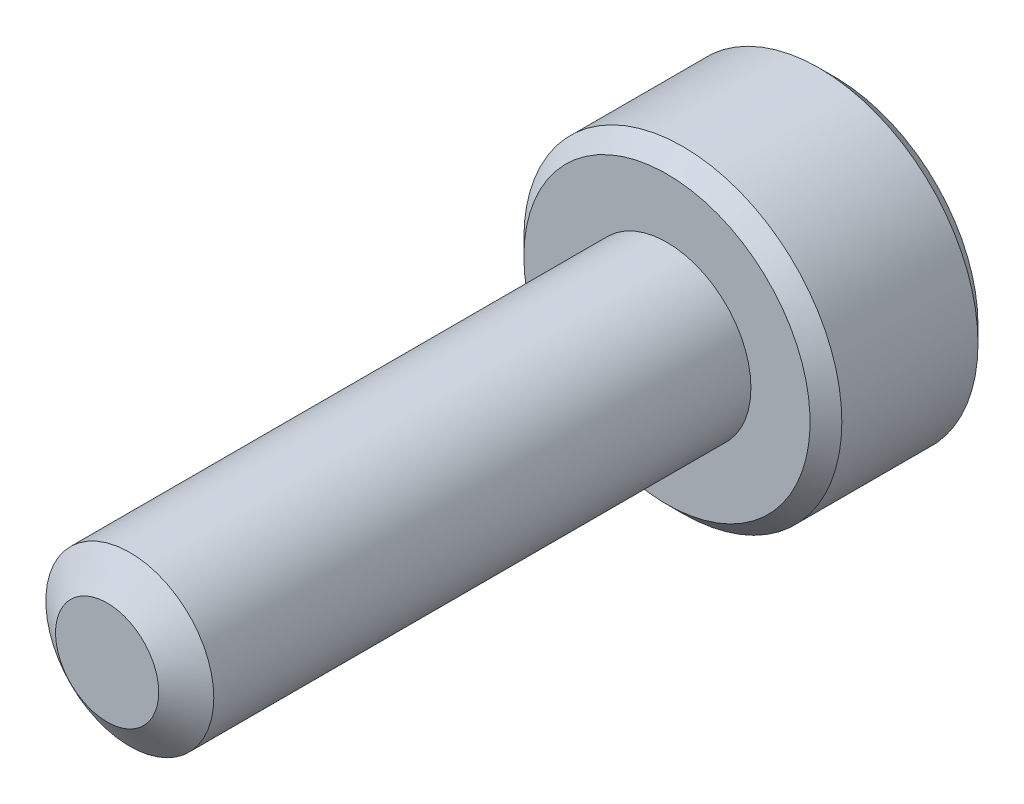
ISO-10303-21;
HEADER;
FILE_DESCRIPTION(('STEP AP214'),'2;1');
FILE_NAME('part.step','',(''),(''),'','','');
FILE_SCHEMA(('AUTOMOTIVE_DESIGN { 1 0 10303 214 1 1 1 1 }'));
ENDSEC;
DATA;
#1=APPLICATION_CONTEXT('core data for automotive mechanical design processes');
#2=APPLICATION_PROTOCOL_DEFINITION('international standard','automotive_design',2000,#1);
#3=PRODUCT_CONTEXT('',#1,'mechanical');
#4=PRODUCT('Part','Part','',(#3));
#5=PRODUCT_RELATED_PRODUCT_CATEGORY('part','',(#4));
#6=PRODUCT_DEFINITION_FORMATION('','',#4);
#7=PRODUCT_DEFINITION_CONTEXT('part definition',#1,'design');
#8=PRODUCT_DEFINITION('design','',#6,#7);
#9=PRODUCT_DEFINITION_SHAPE('','',#8);
#10=(LENGTH_UNIT() NAMED_UNIT(*) SI_UNIT(.MILLI.,.METRE.));
#11=(NAMED_UNIT(*) PLANE_ANGLE_UNIT() SI_UNIT($,.RADIAN.));
#12=(NAMED_UNIT(*) SI_UNIT($,.STERADIAN.) SOLID_ANGLE_UNIT());
#13=UNCERTAINTY_MEASURE_WITH_UNIT(LENGTH_MEASURE(1.E-05),#10,'distance_accuracy_value','');
#14=(GEOMETRIC_REPRESENTATION_CONTEXT(3) GLOBAL_UNCERTAINTY_ASSIGNED_CONTEXT((#13)) GLOBAL_UNIT_ASSIGNED_CONTEXT((#10,
#11,#12)) REPRESENTATION_CONTEXT('',''));
#15=CARTESIAN_POINT('',(0.,0.,0.));
#16=DIRECTION('',(0.,0.,1.));
#17=DIRECTION('',(1.,0.,0.));
#18=AXIS2_PLACEMENT_3D('',#15,#16,#17);
#19=CARTESIAN_POINT('',(0.,0.,-9.99999999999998));
#20=DIRECTION('',(0.,0.,0.999999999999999));
#21=DIRECTION('',(1.,0.,0.));
#22=AXIS2_PLACEMENT_3D('',#19,#20,#21);
#23=CYLINDRICAL_SURFACE('',#22,1.5);
#24=CARTESIAN_POINT('',(0.,0.,-9.99999999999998));
#25=DIRECTION('',(0.,0.,-0.999999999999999));
#26=DIRECTION('',(-1.,0.,0.));
#27=AXIS2_PLACEMENT_3D('',#24,#25,#26);
#28=CIRCLE('',#27,1.5);
#29=CARTESIAN_POINT('',(1.5,0.,-9.99999999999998));
#30=VERTEX_POINT('',#29);
#31=EDGE_CURVE('E211',#30,#30,#28,.F.);
#32=CARTESIAN_POINT('',(0.,0.,-0.405251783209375));
#33=DIRECTION('',(0.,0.,0.999999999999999));
#34=DIRECTION('',(1.,0.,0.));
#35=AXIS2_PLACEMENT_3D('',#32,#33,#34);
#36=CIRCLE('',#35,1.5);
#37=CARTESIAN_POINT('',(1.5,0.,-0.405251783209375));
#38=VERTEX_POINT('',#37);
#39=EDGE_CURVE('E108',#38,#38,#36,.T.);
#40=CARTESIAN_POINT('',(1.5,0.,-9.99999999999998));
#41=CARTESIAN_POINT('',(1.5,0.,-9.90005470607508));
#42=CARTESIAN_POINT('',(1.5,0.,-9.80010941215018));
#43=CARTESIAN_POINT('',(1.5,0.,-9.60021882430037));
#44=CARTESIAN_POINT('',(1.5,0.,-9.50027353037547));
#45=CARTESIAN_POINT('',(1.5,0.,-9.30038294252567));
#46=CARTESIAN_POINT('',(1.5,0.,-9.20043764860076));
#47=CARTESIAN_POINT('',(1.5,0.,-9.00054706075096));
#48=CARTESIAN_POINT('',(1.5,0.,-8.90060176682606));
#49=CARTESIAN_POINT('',(1.5,0.,-8.70071117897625));
#50=CARTESIAN_POINT('',(1.5,0.,-8.60076588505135));
#51=CARTESIAN_POINT('',(1.5,0.,-8.40087529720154));
#52=CARTESIAN_POINT('',(1.5,0.,-8.30093000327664));
#53=CARTESIAN_POINT('',(1.5,0.,-8.10103941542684));
#54=CARTESIAN_POINT('',(1.5,0.,-8.00109412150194));
#55=CARTESIAN_POINT('',(1.5,0.,-7.80120353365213));
#56=CARTESIAN_POINT('',(1.5,0.,-7.70125823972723));
#57=CARTESIAN_POINT('',(1.5,0.,-7.50136765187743));
#58=CARTESIAN_POINT('',(1.5,0.,-7.40142235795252));
#59=CARTESIAN_POINT('',(1.5,0.,-7.20153177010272));
#60=CARTESIAN_POINT('',(1.5,0.,-7.10158647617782));
#61=CARTESIAN_POINT('',(1.5,0.,-6.90169588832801));
#62=CARTESIAN_POINT('',(1.5,0.,-6.80175059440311));
#63=CARTESIAN_POINT('',(1.5,0.,-6.60186000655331));
#64=CARTESIAN_POINT('',(1.5,0.,-6.50191471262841));
#65=CARTESIAN_POINT('',(1.5,0.,-6.3020241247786));
#66=CARTESIAN_POINT('',(1.5,0.,-6.2020788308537));
#67=CARTESIAN_POINT('',(1.5,0.,-6.00218824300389));
#68=CARTESIAN_POINT('',(1.5,0.,-5.90224294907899));
#69=CARTESIAN_POINT('',(1.5,0.,-5.70235236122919));
#70=CARTESIAN_POINT('',(1.5,0.,-5.60240706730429));
#71=CARTESIAN_POINT('',(1.5,0.,-5.40251647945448));
#72=CARTESIAN_POINT('',(1.5,0.,-5.30257118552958));
#73=CARTESIAN_POINT('',(1.5,0.,-5.10268059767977));
#74=CARTESIAN_POINT('',(1.5,0.,-5.00273530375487));
#75=CARTESIAN_POINT('',(1.5,0.,-4.80284471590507));
#76=CARTESIAN_POINT('',(1.5,0.,-4.70289942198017));
#77=CARTESIAN_POINT('',(1.5,0.,-4.50300883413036));
#78=CARTESIAN_POINT('',(1.5,0.,-4.40306354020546));
#79=CARTESIAN_POINT('',(1.5,0.,-4.20317295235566));
#80=CARTESIAN_POINT('',(1.5,0.,-4.10322765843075));
#81=CARTESIAN_POINT('',(1.5,0.,-3.90333707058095));
#82=CARTESIAN_POINT('',(1.5,0.,-3.80339177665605));
#83=CARTESIAN_POINT('',(1.5,0.,-3.60350118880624));
#84=CARTESIAN_POINT('',(1.5,0.,-3.50355589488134));
#85=CARTESIAN_POINT('',(1.5,0.,-3.30366530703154));
#86=CARTESIAN_POINT('',(1.5,0.,-3.20372001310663));
#87=CARTESIAN_POINT('',(1.5,0.,-3.00382942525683));
#88=CARTESIAN_POINT('',(1.5,0.,-2.90388413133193));
#89=CARTESIAN_POINT('',(1.5,0.,-2.70399354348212));
#90=CARTESIAN_POINT('',(1.5,0.,-2.60404824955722));
#91=CARTESIAN_POINT('',(1.5,0.,-2.40415766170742));
#92=CARTESIAN_POINT('',(1.5,0.,-2.30421236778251));
#93=CARTESIAN_POINT('',(1.5,0.,-2.10432177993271));
#94=CARTESIAN_POINT('',(1.5,0.,-2.00437648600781));
#95=CARTESIAN_POINT('',(1.5,0.,-1.804485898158));
#96=CARTESIAN_POINT('',(1.5,0.,-1.7045406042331));
#97=CARTESIAN_POINT('',(1.5,0.,-1.5046500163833));
#98=CARTESIAN_POINT('',(1.5,0.,-1.40470472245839));
#99=CARTESIAN_POINT('',(1.5,0.,-1.20481413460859));
#100=CARTESIAN_POINT('',(1.5,0.,-1.10486884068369));
#101=CARTESIAN_POINT('',(1.5,0.,-0.904978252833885));
#102=CARTESIAN_POINT('',(1.5,0.,-0.805032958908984));
#103=CARTESIAN_POINT('',(1.5,0.,-0.605142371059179));
#104=CARTESIAN_POINT('',(1.5,0.,-0.505197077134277));
#105=CARTESIAN_POINT('',(1.5,0.,-0.405251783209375));
#106=B_SPLINE_CURVE_WITH_KNOTS('',3,(#40,#41,#42,#43,#44,#45,#46,#47,#48,#49,#50,#51,#52,#53,
#54,#55,#56,#57,#58,#59,#60,#61,#62,#63,#64,#65,#66,#67,#68,#69,#70,#71,#72,#73,#74,#75,#76,#77,
#78,#79,#80,#81,#82,#83,#84,#85,#86,#87,#88,#89,#90,#91,#92,#93,#94,#95,#96,#97,#98,#99,#100,
#101,#102,#103,#104,#105),.UNSPECIFIED.,.F.,.F.,(4,2,2,2,2,2,2,2,2,2,2,2,2,2,2,2,2,2,2,2,2,2,2,
2,2,2,2,2,2,2,2,2,4),(0.,0.299835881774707,0.599671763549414,0.89950764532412,1.19934352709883,
1.49917940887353,1.79901529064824,2.09885117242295,2.39868705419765,2.69852293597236,
2.99835881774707,3.29819469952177,3.59803058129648,3.89786646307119,4.19770234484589,
4.4975382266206,4.7973741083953,5.09720999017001,5.39704587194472,5.69688175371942,
5.99671763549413,6.29655351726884,6.59638939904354,6.89622528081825,7.19606116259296,
7.49589704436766,7.79573292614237,8.09556880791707,8.39540468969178,8.69524057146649,
8.99507645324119,9.2949123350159,9.59474821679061),.UNSPECIFIED.);
#107=EDGE_CURVE('BSEAM34',#30,#38,#106,.T.);
#108=ORIENTED_EDGE('',*,*,#31,.T.);
#109=ORIENTED_EDGE('',*,*,#39,.F.);
#110=ORIENTED_EDGE('',*,*,#107,.T.);
#111=ORIENTED_EDGE('',*,*,#107,.F.);
#112=EDGE_LOOP('',(#108,#110,#109,#111));
#113=FACE_BOUND('',#112,.T.);
#114=ADVANCED_FACE('F34',(#113),#23,.T.);
#115=CARTESIAN_POINT('',(0.,0.,0.));
#116=DIRECTION('',(0.,0.,-0.999999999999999));
#117=DIRECTION('',(-1.,0.,0.));
#118=AXIS2_PLACEMENT_3D('',#115,#116,#117);
#119=CONICAL_SURFACE('',#118,0.921240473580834,0.959931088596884);
#120=ORIENTED_EDGE('',*,*,#39,.T.);
#121=EDGE_LOOP('',(#120));
#122=FACE_BOUND('',#121,.T.);
#123=CARTESIAN_POINT('',(0.,0.,0.));
#124=DIRECTION('',(0.,0.,0.999999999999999));
#125=DIRECTION('',(1.,0.,0.));
#126=AXIS2_PLACEMENT_3D('',#123,#124,#125);
#127=CIRCLE('',#126,0.921240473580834);
#128=CARTESIAN_POINT('',(0.921240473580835,0.,0.));
#129=VERTEX_POINT('',#128);
#130=EDGE_CURVE('E209',#129,#129,#127,.T.);
#131=ORIENTED_EDGE('',*,*,#130,.F.);
#132=EDGE_LOOP('',(#131));
#133=FACE_BOUND('',#132,.T.);
#134=ADVANCED_FACE('F192',(#122,#133),#119,.T.);
#135=CARTESIAN_POINT('',(0.,0.,0.));
#136=DIRECTION('',(0.,0.,0.999999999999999));
#137=DIRECTION('',(1.,0.,0.));
#138=AXIS2_PLACEMENT_3D('',#135,#136,#137);
#139=PLANE('',#138);
#140=ORIENTED_EDGE('',*,*,#130,.T.);
#141=EDGE_LOOP('',(#140));
#142=FACE_BOUND('',#141,.T.);
#143=ADVANCED_FACE('F189',(#142),#139,.T.);
#144=CARTESIAN_POINT('',(0.,0.,-13.));
#145=DIRECTION('',(0.,0.,0.999999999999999));
#146=DIRECTION('',(1.,0.,0.));
#147=AXIS2_PLACEMENT_3D('',#144,#145,#146);
#148=CYLINDRICAL_SURFACE('',#147,2.84);
#149=CARTESIAN_POINT('',(0.,0.,-12.716));
#150=DIRECTION('',(0.,0.,-0.999999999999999));
#151=DIRECTION('',(-1.,0.,0.));
#152=AXIS2_PLACEMENT_3D('',#149,#150,#151);
#153=CIRCLE('',#152,2.84);
#154=CARTESIAN_POINT('',(2.84,0.,-12.716));
#155=VERTEX_POINT('',#154);
#156=EDGE_CURVE('E42',#155,#155,#153,.F.);
#157=CARTESIAN_POINT('',(0.,0.,-10.284));
#158=DIRECTION('',(0.,0.,-0.999999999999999));
#159=DIRECTION('',(-1.,0.,0.));
#160=AXIS2_PLACEMENT_3D('',#157,#158,#159);
#161=CIRCLE('',#160,2.84);
#162=CARTESIAN_POINT('',(2.84,0.,-10.284));
#163=VERTEX_POINT('',#162);
#164=EDGE_CURVE('E168',#163,#163,#161,.T.);
#165=CARTESIAN_POINT('',(2.84,0.,-12.716));
#166=CARTESIAN_POINT('',(2.84,0.,-12.6906666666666));
#167=CARTESIAN_POINT('',(2.84,0.,-12.6653333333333));
#168=CARTESIAN_POINT('',(2.84,0.,-12.6146666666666));
#169=CARTESIAN_POINT('',(2.84,0.,-12.5893333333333));
#170=CARTESIAN_POINT('',(2.84,0.,-12.5386666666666));
#171=CARTESIAN_POINT('',(2.84,0.,-12.5133333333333));
#172=CARTESIAN_POINT('',(2.84,0.,-12.4626666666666));
#173=CARTESIAN_POINT('',(2.84,0.,-12.4373333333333));
#174=CARTESIAN_POINT('',(2.84,0.,-12.3866666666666));
#175=CARTESIAN_POINT('',(2.84,0.,-12.3613333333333));
#176=CARTESIAN_POINT('',(2.84,0.,-12.3106666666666));
#177=CARTESIAN_POINT('',(2.84,0.,-12.2853333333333));
#178=CARTESIAN_POINT('',(2.84,0.,-12.2346666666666));
#179=CARTESIAN_POINT('',(2.84,0.,-12.2093333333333));
#180=CARTESIAN_POINT('',(2.84,0.,-12.1586666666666));
#181=CARTESIAN_POINT('',(2.84,0.,-12.1333333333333));
#182=CARTESIAN_POINT('',(2.84,0.,-12.0826666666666));
#183=CARTESIAN_POINT('',(2.84,0.,-12.0573333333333));
#184=CARTESIAN_POINT('',(2.84,0.,-12.0066666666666));
#185=CARTESIAN_POINT('',(2.84,0.,-11.9813333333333));
#186=CARTESIAN_POINT('',(2.84,0.,-11.9306666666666));
#187=CARTESIAN_POINT('',(2.84,0.,-11.9053333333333));
#188=CARTESIAN_POINT('',(2.84,0.,-11.8546666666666));
#189=CARTESIAN_POINT('',(2.84,0.,-11.8293333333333));
#190=CARTESIAN_POINT('',(2.84,0.,-11.7786666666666));
#191=CARTESIAN_POINT('',(2.84,0.,-11.7533333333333));
#192=CARTESIAN_POINT('',(2.84,0.,-11.7026666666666));
#193=CARTESIAN_POINT('',(2.84,0.,-11.6773333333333));
#194=CARTESIAN_POINT('',(2.84,0.,-11.6266666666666));
#195=CARTESIAN_POINT('',(2.84,0.,-11.6013333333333));
#196=CARTESIAN_POINT('',(2.84,0.,-11.5506666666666));
#197=CARTESIAN_POINT('',(2.84,0.,-11.5253333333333));
#198=CARTESIAN_POINT('',(2.84,0.,-11.4746666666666));
#199=CARTESIAN_POINT('',(2.84,0.,-11.4493333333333));
#200=CARTESIAN_POINT('',(2.84,0.,-11.3986666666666));
#201=CARTESIAN_POINT('',(2.84,0.,-11.3733333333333));
#202=CARTESIAN_POINT('',(2.84,0.,-11.3226666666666));
#203=CARTESIAN_POINT('',(2.84,0.,-11.2973333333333));
#204=CARTESIAN_POINT('',(2.84,0.,-11.2466666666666));
#205=CARTESIAN_POINT('',(2.84,0.,-11.2213333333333));
#206=CARTESIAN_POINT('',(2.84,0.,-11.1706666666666));
#207=CARTESIAN_POINT('',(2.84,0.,-11.1453333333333));
#208=CARTESIAN_POINT('',(2.84,0.,-11.0946666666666));
#209=CARTESIAN_POINT('',(2.84,0.,-11.0693333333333));
#210=CARTESIAN_POINT('',(2.84,0.,-11.0186666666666));
#211=CARTESIAN_POINT('',(2.84,0.,-10.9933333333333));
#212=CARTESIAN_POINT('',(2.84,0.,-10.9426666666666));
#213=CARTESIAN_POINT('',(2.84,0.,-10.9173333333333));
#214=CARTESIAN_POINT('',(2.84,0.,-10.8666666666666));
#215=CARTESIAN_POINT('',(2.84,0.,-10.8413333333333));
#216=CARTESIAN_POINT('',(2.84,0.,-10.7906666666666));
#217=CARTESIAN_POINT('',(2.84,0.,-10.7653333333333));
#218=CARTESIAN_POINT('',(2.84,0.,-10.7146666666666));
#219=CARTESIAN_POINT('',(2.84,0.,-10.6893333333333));
#220=CARTESIAN_POINT('',(2.84,0.,-10.6386666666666));
#221=CARTESIAN_POINT('',(2.84,0.,-10.6133333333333));
#222=CARTESIAN_POINT('',(2.84,0.,-10.5626666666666));
#223=CARTESIAN_POINT('',(2.84,0.,-10.5373333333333));
#224=CARTESIAN_POINT('',(2.84,0.,-10.4866666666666));
#225=CARTESIAN_POINT('',(2.84,0.,-10.4613333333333));
#226=CARTESIAN_POINT('',(2.84,0.,-10.4106666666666));
#227=CARTESIAN_POINT('',(2.84,0.,-10.3853333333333));
#228=CARTESIAN_POINT('',(2.84,0.,-10.3346666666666));
#229=CARTESIAN_POINT('',(2.84,0.,-10.3093333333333));
#230=CARTESIAN_POINT('',(2.84,0.,-10.284));
#231=B_SPLINE_CURVE_WITH_KNOTS('',3,(#165,#166,#167,#168,#169,#170,#171,#172,#173,#174,#175,
#176,#177,#178,#179,#180,#181,#182,#183,#184,#185,#186,#187,#188,#189,#190,#191,#192,#193,#194,
#195,#196,#197,#198,#199,#200,#201,#202,#203,#204,#205,#206,#207,#208,#209,#210,#211,#212,#213,
#214,#215,#216,#217,#218,#219,#220,#221,#222,#223,#224,#225,#226,#227,#228,#229,#230),
.UNSPECIFIED.,.F.,.F.,(4,2,2,2,2,2,2,2,2,2,2,2,2,2,2,2,2,2,2,2,2,2,2,2,2,2,2,2,2,2,2,2,4),(0.,
0.0759999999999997,0.151999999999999,0.227999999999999,0.303999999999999,0.379999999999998,
0.455999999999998,0.531999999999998,0.607999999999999,0.683999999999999,0.759999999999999,
0.835999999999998,0.911999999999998,0.987999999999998,1.064,1.14,1.216,1.292,1.368,1.444,1.52,
1.596,1.672,1.748,1.824,1.9,1.976,2.052,2.128,2.204,2.28,2.356,2.432),.UNSPECIFIED.);
#232=EDGE_CURVE('BSEAM173',#155,#163,#231,.T.);
#233=ORIENTED_EDGE('',*,*,#156,.T.);
#234=ORIENTED_EDGE('',*,*,#164,.T.);
#235=ORIENTED_EDGE('',*,*,#232,.T.);
#236=ORIENTED_EDGE('',*,*,#232,.F.);
#237=EDGE_LOOP('',(#233,#235,#234,#236));
#238=FACE_BOUND('',#237,.T.);
#239=ADVANCED_FACE('F173',(#238),#148,.T.);
#240=CARTESIAN_POINT('',(0.,0.,-13.));
#241=DIRECTION('',(0.,0.,-0.999999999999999));
#242=DIRECTION('',(-1.,0.,0.));
#243=AXIS2_PLACEMENT_3D('',#240,#241,#242);
#244=PLANE('',#243);
#245=CARTESIAN_POINT('',(0.,0.,-13.));
#246=DIRECTION('',(0.,0.,-0.999999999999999));
#247=DIRECTION('',(-1.,0.,0.));
#248=AXIS2_PLACEMENT_3D('',#245,#246,#247);
#249=CIRCLE('',#248,2.556);
#250=CARTESIAN_POINT('',(2.556,0.,-13.));
#251=VERTEX_POINT('',#250);
#252=EDGE_CURVE('E107',#251,#251,#249,.T.);
#253=ORIENTED_EDGE('',*,*,#252,.T.);
#254=EDGE_LOOP('',(#253));
#255=FACE_BOUND('',#254,.T.);
#256=CARTESIAN_POINT('',(0.,0.,-13.));
#257=DIRECTION('',(0.,0.,-0.999999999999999));
#258=DIRECTION('',(-1.,0.,0.));
#259=AXIS2_PLACEMENT_3D('',#256,#257,#258);
#260=CIRCLE('',#259,1.44337567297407);
#261=CARTESIAN_POINT('',(-1.25,0.721687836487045,-13.));
#262=VERTEX_POINT('',#261);
#263=CARTESIAN_POINT('',(0.,1.44337567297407,-13.));
#264=VERTEX_POINT('',#263);
#265=EDGE_CURVE('E88',#262,#264,#260,.T.);
#266=ORIENTED_EDGE('',*,*,#265,.F.);
#267=CARTESIAN_POINT('',(-1.25,-0.721687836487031,-13.));
#268=VERTEX_POINT('',#267);
#269=EDGE_CURVE('E48',#268,#262,#260,.T.);
#270=ORIENTED_EDGE('',*,*,#269,.F.);
#271=CARTESIAN_POINT('',(0.,-1.44337567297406,-13.));
#272=VERTEX_POINT('',#271);
#273=EDGE_CURVE('E267',#272,#268,#260,.T.);
#274=ORIENTED_EDGE('',*,*,#273,.F.);
#275=CARTESIAN_POINT('',(1.25,-0.721687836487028,-13.));
#276=VERTEX_POINT('',#275);
#277=EDGE_CURVE('E55',#276,#272,#260,.T.);
#278=ORIENTED_EDGE('',*,*,#277,.F.);
#279=CARTESIAN_POINT('',(1.25,0.721687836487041,-13.));
#280=VERTEX_POINT('',#279);
#281=EDGE_CURVE('E129',#280,#276,#260,.T.);
#282=ORIENTED_EDGE('',*,*,#281,.F.);
#283=EDGE_CURVE('E97',#264,#280,#260,.T.);
#284=ORIENTED_EDGE('',*,*,#283,.F.);
#285=EDGE_LOOP('',(#266,#270,#274,#278,#282,#284));
#286=FACE_BOUND('',#285,.T.);
#287=ADVANCED_FACE('F128',(#255,#286),#244,.T.);
#288=CARTESIAN_POINT('',(0.,0.,-9.99999999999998));
#289=DIRECTION('',(0.,0.,-0.999999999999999));
#290=DIRECTION('',(-1.,0.,0.));
#291=AXIS2_PLACEMENT_3D('',#288,#289,#290);
#292=PLANE('',#291);
#293=CARTESIAN_POINT('',(0.,0.,-9.99999999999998));
#294=DIRECTION('',(0.,0.,-0.999999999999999));
#295=DIRECTION('',(-1.,0.,0.));
#296=AXIS2_PLACEMENT_3D('',#293,#294,#295);
#297=CIRCLE('',#296,2.556);
#298=CARTESIAN_POINT('',(-2.556,0.,-9.99999999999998));
#299=VERTEX_POINT('',#298);
#300=EDGE_CURVE('E11',#299,#299,#297,.F.);
#301=ORIENTED_EDGE('',*,*,#300,.T.);
#302=EDGE_LOOP('',(#301));
#303=FACE_BOUND('',#302,.T.);
#304=ORIENTED_EDGE('',*,*,#31,.F.);
#305=EDGE_LOOP('',(#304));
#306=FACE_BOUND('',#305,.T.);
#307=ADVANCED_FACE('F182',(#303,#306),#292,.F.);
#308=CARTESIAN_POINT('',(0.,0.,-13.));
#309=DIRECTION('',(0.,0.,-0.999999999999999));
#310=DIRECTION('',(-1.,0.,0.));
#311=AXIS2_PLACEMENT_3D('',#308,#309,#310);
#312=CONICAL_SURFACE('',#311,1.44337567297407,0.78539816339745);
#313=ORIENTED_EDGE('',*,*,#283,.T.);
#314=CARTESIAN_POINT('',(-0.00019999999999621,1.44349114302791,-13.0001154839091));
#315=CARTESIAN_POINT('',(0.04277516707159,1.41867941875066,-12.9753216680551));
#316=CARTESIAN_POINT('',(0.0864690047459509,1.39345276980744,-12.9519837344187));
#317=CARTESIAN_POINT('',(0.175565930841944,1.34201263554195,-12.9092520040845));
#318=CARTESIAN_POINT('',(0.220977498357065,1.31579425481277,-12.8898819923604));
#319=CARTESIAN_POINT('',(0.31254782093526,1.26292610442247,-12.8567004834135));
#320=CARTESIAN_POINT('',(0.358683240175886,1.23628980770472,-12.8428055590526));
#321=CARTESIAN_POINT('',(0.451970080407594,1.18243062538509,-12.8213972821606));
#322=CARTESIAN_POINT('',(0.499118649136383,1.15520938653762,-12.8138679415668));
#323=CARTESIAN_POINT('',(0.580373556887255,1.10829684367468,-12.8070744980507));
#324=CARTESIAN_POINT('',(0.614374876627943,1.08866617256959,-12.8060685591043));
#325=CARTESIAN_POINT('',(0.682317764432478,1.04943932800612,-12.8077614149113));
#326=CARTESIAN_POINT('',(0.716259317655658,1.029843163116,-12.8104610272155));
#327=CARTESIAN_POINT('',(0.7838148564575,0.990839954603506,-12.8194089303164));
#328=CARTESIAN_POINT('',(0.817428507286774,0.971433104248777,-12.8256605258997));
#329=CARTESIAN_POINT('',(0.884094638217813,0.932943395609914,-12.8413756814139));
#330=CARTESIAN_POINT('',(0.917146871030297,0.913860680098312,-12.8508406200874));
#331=CARTESIAN_POINT('',(1.00179969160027,0.864986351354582,-12.8789313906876));
#332=CARTESIAN_POINT('',(1.05286649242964,0.835502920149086,-12.8996701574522));
#333=CARTESIAN_POINT('',(1.15300085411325,0.777690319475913,-12.9463871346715));
#334=CARTESIAN_POINT('',(1.20207431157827,0.74935774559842,-12.9723482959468));
#335=CARTESIAN_POINT('',(1.25020000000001,0.721572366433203,-13.0001154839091));
#336=B_SPLINE_CURVE_WITH_KNOTS('',3,(#314,#315,#316,#317,#318,#319,#320,#321,#322,#323,#324,
#325,#326,#327,#328,#329,#330,#331,#332,#333,#334,#335),.UNSPECIFIED.,.F.,.F.,(4,2,2,2,2,2,2,2,
2,2,4),(0.,0.166533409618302,0.334037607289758,0.498880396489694,0.663307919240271,
0.780963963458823,0.898645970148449,1.01643764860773,1.13427993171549,1.3214865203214,
1.50809158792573),.UNSPECIFIED.);
#337=EDGE_CURVE('E102',#264,#280,#336,.T.);
#338=ORIENTED_EDGE('',*,*,#337,.F.);
#339=EDGE_LOOP('',(#313,#338));
#340=FACE_BOUND('',#339,.T.);
#341=ADVANCED_FACE('F103',(#340),#312,.F.);
#342=ORIENTED_EDGE('',*,*,#281,.T.);
#343=CARTESIAN_POINT('',(1.25,-1.43934010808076,-13.4629820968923));
#344=CARTESIAN_POINT('',(1.25,-1.40429313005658,-13.4365249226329));
#345=CARTESIAN_POINT('',(1.25,-1.36905087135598,-13.4103271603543));
#346=CARTESIAN_POINT('',(1.25,-1.2980965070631,-13.3585575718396));
#347=CARTESIAN_POINT('',(1.25,-1.26238428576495,-13.3329859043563));
#348=CARTESIAN_POINT('',(1.25,-1.15390111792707,-13.2570059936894));
#349=CARTESIAN_POINT('',(1.25,-1.08031646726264,-13.2077402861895));
#350=CARTESIAN_POINT('',(1.25,-0.926012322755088,-13.1110258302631));
#351=CARTESIAN_POINT('',(1.25,-0.845125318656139,-13.0638412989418));
#352=CARTESIAN_POINT('',(1.25,-0.679311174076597,-12.9775307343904));
#353=CARTESIAN_POINT('',(1.25,-0.594398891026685,-12.9383775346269));
#354=CARTESIAN_POINT('',(1.25,-0.466944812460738,-12.8904772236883));
#355=CARTESIAN_POINT('',(1.25,-0.426289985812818,-12.8767294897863));
#356=CARTESIAN_POINT('',(1.25,-0.343998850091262,-12.8524979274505));
#357=CARTESIAN_POINT('',(1.25,-0.302362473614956,-12.8420143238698));
#358=CARTESIAN_POINT('',(1.25,-0.219052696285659,-12.8250301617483));
#359=CARTESIAN_POINT('',(1.25,-0.177393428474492,-12.8184613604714));
#360=CARTESIAN_POINT('',(1.25,-0.0936293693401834,-12.8094350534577));
#361=CARTESIAN_POINT('',(1.25000000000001,-0.0515246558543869,-12.8069768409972));
#362=CARTESIAN_POINT('',(1.25000000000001,0.0311890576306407,-12.8063540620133));
#363=CARTESIAN_POINT('',(1.25,0.0717969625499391,-12.8080371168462));
#364=CARTESIAN_POINT('',(1.25,0.152668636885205,-12.8152682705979));
#365=CARTESIAN_POINT('',(1.25,0.192932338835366,-12.8208171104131));
#366=CARTESIAN_POINT('',(1.25,0.273499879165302,-12.8355710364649));
#367=CARTESIAN_POINT('',(1.25,0.313792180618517,-12.8448381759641));
#368=CARTESIAN_POINT('',(1.25,0.393496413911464,-12.8665361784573));
#369=CARTESIAN_POINT('',(1.25,0.432908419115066,-12.8789667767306));
#370=CARTESIAN_POINT('',(1.25,0.556992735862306,-12.9227793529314));
#371=CARTESIAN_POINT('',(1.25,0.63989892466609,-12.9591510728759));
#372=CARTESIAN_POINT('',(1.25,0.801816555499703,-13.0400191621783));
#373=CARTESIAN_POINT('',(1.25,0.880812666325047,-13.084544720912));
#374=CARTESIAN_POINT('',(1.25,1.0317856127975,-13.1764048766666));
#375=CARTESIAN_POINT('',(1.25,1.10391618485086,-13.2234899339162));
#376=CARTESIAN_POINT('',(1.25,1.21018606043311,-13.2962785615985));
#377=CARTESIAN_POINT('',(1.25,1.2451506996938,-13.3207980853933));
#378=CARTESIAN_POINT('',(1.25,1.31460220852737,-13.3704856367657));
#379=CARTESIAN_POINT('',(1.25,1.34908920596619,-13.3956534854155));
#380=CARTESIAN_POINT('',(1.25000000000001,1.38337731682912,-13.4210901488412));
#381=B_SPLINE_CURVE_WITH_KNOTS('',3,(#343,#344,#345,#346,#347,#348,#349,#350,#351,#352,#353,
#354,#355,#356,#357,#358,#359,#360,#361,#362,#363,#364,#365,#366,#367,#368,#369,#370,#371,#372,
#373,#374,#375,#376,#377,#378,#379,#380),.UNSPECIFIED.,.F.,.F.,(4,2,2,2,2,2,2,2,2,2,2,2,2,2,2,2,
2,2,4),(0.,0.131732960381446,0.263498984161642,0.529042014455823,0.809741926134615,
1.08947609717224,1.21811634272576,1.346765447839,1.47310084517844,1.59941451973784,
1.72115042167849,1.84290966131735,1.96679153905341,2.09066305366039,2.36146692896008,
2.6332598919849,2.89154668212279,3.01965734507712,3.14773302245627),.UNSPECIFIED.);
#382=EDGE_CURVE('E96',#280,#276,#381,.F.);
#383=ORIENTED_EDGE('',*,*,#382,.F.);
#384=EDGE_LOOP('',(#342,#383));
#385=FACE_BOUND('',#384,.T.);
#386=ADVANCED_FACE('F273',(#385),#312,.F.);
#387=ORIENTED_EDGE('',*,*,#277,.T.);
#388=CARTESIAN_POINT('',(1.2502,-0.72157236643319,-13.0001154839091));
#389=CARTESIAN_POINT('',(1.20722483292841,-0.746384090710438,-12.9753216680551));
#390=CARTESIAN_POINT('',(1.16353099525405,-0.771610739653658,-12.9519837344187));
#391=CARTESIAN_POINT('',(1.07443406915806,-0.823050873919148,-12.9092520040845));
#392=CARTESIAN_POINT('',(1.02902250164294,-0.849269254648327,-12.8898819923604));
#393=CARTESIAN_POINT('',(0.93745217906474,-0.902137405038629,-12.8567004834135));
#394=CARTESIAN_POINT('',(0.891316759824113,-0.928773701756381,-12.8428055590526));
#395=CARTESIAN_POINT('',(0.798029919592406,-0.982632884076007,-12.8213972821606));
#396=CARTESIAN_POINT('',(0.750881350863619,-1.00985412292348,-12.8138679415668));
#397=CARTESIAN_POINT('',(0.669626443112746,-1.05676666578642,-12.8070744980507));
#398=CARTESIAN_POINT('',(0.635625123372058,-1.07639733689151,-12.8060685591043));
#399=CARTESIAN_POINT('',(0.567682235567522,-1.11562418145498,-12.8077614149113));
#400=CARTESIAN_POINT('',(0.533740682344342,-1.1352203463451,-12.8104610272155));
#401=CARTESIAN_POINT('',(0.466185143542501,-1.17422355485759,-12.8194089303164));
#402=CARTESIAN_POINT('',(0.432571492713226,-1.19363040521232,-12.8256605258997));
#403=CARTESIAN_POINT('',(0.365905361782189,-1.23212011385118,-12.8413756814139));
#404=CARTESIAN_POINT('',(0.332853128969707,-1.25120282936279,-12.8508406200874));
#405=CARTESIAN_POINT('',(0.248200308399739,-1.30007715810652,-12.8789313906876));
#406=CARTESIAN_POINT('',(0.197133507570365,-1.32956058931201,-12.8996701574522));
#407=CARTESIAN_POINT('',(0.0969991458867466,-1.38737318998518,-12.9463871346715));
#408=CARTESIAN_POINT('',(0.0479256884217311,-1.41570576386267,-12.9723482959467));
#409=CARTESIAN_POINT('',(-0.000200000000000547,-1.4434911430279,-13.0001154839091));
#410=B_SPLINE_CURVE_WITH_KNOTS('',3,(#388,#389,#390,#391,#392,#393,#394,#395,#396,#397,#398,
#399,#400,#401,#402,#403,#404,#405,#406,#407,#408,#409),.UNSPECIFIED.,.F.,.F.,(4,2,2,2,2,2,2,2,
2,2,4),(0.,0.166533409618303,0.334037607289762,0.4988803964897,0.663307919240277,
0.780963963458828,0.898645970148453,1.01643764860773,1.13427993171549,1.32148652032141,
1.50809158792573),.UNSPECIFIED.);
#411=EDGE_CURVE('E138',#276,#272,#410,.T.);
#412=ORIENTED_EDGE('',*,*,#411,.F.);
#413=EDGE_LOOP('',(#387,#412));
#414=FACE_BOUND('',#413,.T.);
#415=ADVANCED_FACE('F270',(#414),#312,.F.);
#416=ORIENTED_EDGE('',*,*,#273,.T.);
#417=CARTESIAN_POINT('',(0.000200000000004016,-1.44349114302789,-13.0001154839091));
#418=CARTESIAN_POINT('',(-0.0427751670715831,-1.41867941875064,-12.9753216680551));
#419=CARTESIAN_POINT('',(-0.0864690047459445,-1.39345276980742,-12.9519837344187));
#420=CARTESIAN_POINT('',(-0.175565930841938,-1.34201263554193,-12.9092520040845));
#421=CARTESIAN_POINT('',(-0.22097749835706,-1.31579425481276,-12.8898819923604));
#422=CARTESIAN_POINT('',(-0.312547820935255,-1.26292610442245,-12.8567004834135));
#423=CARTESIAN_POINT('',(-0.358683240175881,-1.2362898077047,-12.8428055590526));
#424=CARTESIAN_POINT('',(-0.451970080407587,-1.18243062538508,-12.8213972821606));
#425=CARTESIAN_POINT('',(-0.499118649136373,-1.1552093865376,-12.8138679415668));
#426=CARTESIAN_POINT('',(-0.580373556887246,-1.10829684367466,-12.8070744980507));
#427=CARTESIAN_POINT('',(-0.614374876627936,-1.08866617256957,-12.8060685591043));
#428=CARTESIAN_POINT('',(-0.682317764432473,-1.0494393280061,-12.8077614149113));
#429=CARTESIAN_POINT('',(-0.716259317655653,-1.02984316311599,-12.8104610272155));
#430=CARTESIAN_POINT('',(-0.783814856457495,-0.990839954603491,-12.8194089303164));
#431=CARTESIAN_POINT('',(-0.81742850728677,-0.971433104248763,-12.8256605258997));
#432=CARTESIAN_POINT('',(-0.884094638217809,-0.932943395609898,-12.8413756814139));
#433=CARTESIAN_POINT('',(-0.917146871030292,-0.913860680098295,-12.8508406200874));
#434=CARTESIAN_POINT('',(-1.00179969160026,-0.864986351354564,-12.8789313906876));
#435=CARTESIAN_POINT('',(-1.05286649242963,-0.835502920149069,-12.8996701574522));
#436=CARTESIAN_POINT('',(-1.15300085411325,-0.777690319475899,-12.9463871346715));
#437=CARTESIAN_POINT('',(-1.20207431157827,-0.749357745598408,-12.9723482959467));
#438=CARTESIAN_POINT('',(-1.2502,-0.721572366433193,-13.0001154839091));
#439=B_SPLINE_CURVE_WITH_KNOTS('',3,(#417,#418,#419,#420,#421,#422,#423,#424,#425,#426,#427,
#428,#429,#430,#431,#432,#433,#434,#435,#436,#437,#438),.UNSPECIFIED.,.F.,.F.,(4,2,2,2,2,2,2,2,
2,2,4),(0.,0.166533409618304,0.33403760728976,0.498880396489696,0.663307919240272,
0.780963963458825,0.898645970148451,1.01643764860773,1.13427993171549,1.32148652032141,
1.50809158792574),.UNSPECIFIED.);
#440=EDGE_CURVE('E245',#272,#268,#439,.T.);
#441=ORIENTED_EDGE('',*,*,#440,.F.);
#442=EDGE_LOOP('',(#416,#441));
#443=FACE_BOUND('',#442,.T.);
#444=ADVANCED_FACE('F269',(#443),#312,.F.);
#445=ORIENTED_EDGE('',*,*,#269,.T.);
#446=CARTESIAN_POINT('',(-1.25,-1.43934010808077,-13.4629820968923));
#447=CARTESIAN_POINT('',(-1.25,-1.40429313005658,-13.4365249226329));
#448=CARTESIAN_POINT('',(-1.25,-1.36905087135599,-13.4103271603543));
#449=CARTESIAN_POINT('',(-1.25,-1.2980965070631,-13.3585575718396));
#450=CARTESIAN_POINT('',(-1.25,-1.26238428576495,-13.3329859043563));
#451=CARTESIAN_POINT('',(-1.25,-1.15390111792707,-13.2570059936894));
#452=CARTESIAN_POINT('',(-1.25,-1.08031646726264,-13.2077402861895));
#453=CARTESIAN_POINT('',(-1.25,-0.926012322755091,-13.1110258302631));
#454=CARTESIAN_POINT('',(-1.25,-0.845125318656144,-13.0638412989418));
#455=CARTESIAN_POINT('',(-1.25,-0.679311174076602,-12.9775307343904));
#456=CARTESIAN_POINT('',(-1.24999999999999,-0.594398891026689,-12.9383775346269));
#457=CARTESIAN_POINT('',(-1.24999999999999,-0.466944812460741,-12.8904772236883));
#458=CARTESIAN_POINT('',(-1.25,-0.426289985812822,-12.8767294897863));
#459=CARTESIAN_POINT('',(-1.25,-0.343998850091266,-12.8524979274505));
#460=CARTESIAN_POINT('',(-1.25,-0.30236247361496,-12.8420143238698));
#461=CARTESIAN_POINT('',(-1.25,-0.219052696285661,-12.8250301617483));
#462=CARTESIAN_POINT('',(-1.25,-0.177393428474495,-12.8184613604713));
#463=CARTESIAN_POINT('',(-1.25,-0.0936293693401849,-12.8094350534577));
#464=CARTESIAN_POINT('',(-1.25,-0.0515246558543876,-12.8069768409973));
#465=CARTESIAN_POINT('',(-1.25,0.0311890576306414,-12.8063540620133));
#466=CARTESIAN_POINT('',(-1.25,0.0717969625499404,-12.8080371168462));
#467=CARTESIAN_POINT('',(-1.25,0.152668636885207,-12.8152682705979));
#468=CARTESIAN_POINT('',(-1.25,0.192932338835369,-12.8208171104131));
#469=CARTESIAN_POINT('',(-1.25,0.273499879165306,-12.8355710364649));
#470=CARTESIAN_POINT('',(-1.25,0.313792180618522,-12.8448381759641));
#471=CARTESIAN_POINT('',(-1.25,0.393496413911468,-12.8665361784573));
#472=CARTESIAN_POINT('',(-1.25,0.43290841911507,-12.8789667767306));
#473=CARTESIAN_POINT('',(-1.25,0.556992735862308,-12.9227793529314));
#474=CARTESIAN_POINT('',(-1.25,0.639898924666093,-12.9591510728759));
#475=CARTESIAN_POINT('',(-1.25,0.801816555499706,-13.0400191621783));
#476=CARTESIAN_POINT('',(-1.25,0.880812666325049,-13.084544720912));
#477=CARTESIAN_POINT('',(-1.25,1.0317856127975,-13.1764048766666));
#478=CARTESIAN_POINT('',(-1.25,1.10391618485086,-13.2234899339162));
#479=CARTESIAN_POINT('',(-1.25,1.21018606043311,-13.2962785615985));
#480=CARTESIAN_POINT('',(-1.25,1.2451506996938,-13.3207980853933));
#481=CARTESIAN_POINT('',(-1.25,1.31460220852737,-13.3704856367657));
#482=CARTESIAN_POINT('',(-1.25,1.34908920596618,-13.3956534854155));
#483=CARTESIAN_POINT('',(-1.25,1.38337731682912,-13.4210901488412));
#484=B_SPLINE_CURVE_WITH_KNOTS('',3,(#446,#447,#448,#449,#450,#451,#452,#453,#454,#455,#456,
#457,#458,#459,#460,#461,#462,#463,#464,#465,#466,#467,#468,#469,#470,#471,#472,#473,#474,#475,
#476,#477,#478,#479,#480,#481,#482,#483),.UNSPECIFIED.,.F.,.F.,(4,2,2,2,2,2,2,2,2,2,2,2,2,2,2,2,
2,2,4),(0.,0.131732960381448,0.263498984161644,0.529042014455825,0.809741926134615,
1.08947609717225,1.21811634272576,1.346765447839,1.47310084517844,1.59941451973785,
1.7211504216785,1.84290966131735,1.96679153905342,2.0906630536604,2.36146692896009,
2.63325989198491,2.89154668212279,3.01965734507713,3.14773302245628),.UNSPECIFIED.);
#485=EDGE_CURVE('E118',#268,#262,#484,.T.);
#486=ORIENTED_EDGE('',*,*,#485,.F.);
#487=EDGE_LOOP('',(#445,#486));
#488=FACE_BOUND('',#487,.T.);
#489=ADVANCED_FACE('F282',(#488),#312,.F.);
#490=ORIENTED_EDGE('',*,*,#265,.T.);
#491=CARTESIAN_POINT('',(-1.25019999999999,0.721572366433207,-13.0001154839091));
#492=CARTESIAN_POINT('',(-1.20722483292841,0.746384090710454,-12.9753216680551));
#493=CARTESIAN_POINT('',(-1.16353099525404,0.771610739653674,-12.9519837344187));
#494=CARTESIAN_POINT('',(-1.07443406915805,0.823050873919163,-12.9092520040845));
#495=CARTESIAN_POINT('',(-1.02902250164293,0.849269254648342,-12.8898819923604));
#496=CARTESIAN_POINT('',(-0.937452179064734,0.902137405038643,-12.8567004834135));
#497=CARTESIAN_POINT('',(-0.891316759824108,0.928773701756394,-12.8428055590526));
#498=CARTESIAN_POINT('',(-0.798029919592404,0.982632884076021,-12.8213972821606));
#499=CARTESIAN_POINT('',(-0.750881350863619,1.00985412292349,-12.8138679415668));
#500=CARTESIAN_POINT('',(-0.669626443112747,1.05676666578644,-12.8070744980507));
#501=CARTESIAN_POINT('',(-0.635625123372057,1.07639733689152,-12.8060685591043));
#502=CARTESIAN_POINT('',(-0.56768223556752,1.11562418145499,-12.8077614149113));
#503=CARTESIAN_POINT('',(-0.533740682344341,1.13522034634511,-12.8104610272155));
#504=CARTESIAN_POINT('',(-0.466185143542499,1.1742235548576,-12.8194089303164));
#505=CARTESIAN_POINT('',(-0.432571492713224,1.19363040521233,-12.8256605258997));
#506=CARTESIAN_POINT('',(-0.365905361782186,1.2321201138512,-12.8413756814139));
#507=CARTESIAN_POINT('',(-0.332853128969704,1.2512028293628,-12.8508406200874));
#508=CARTESIAN_POINT('',(-0.248200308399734,1.30007715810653,-12.8789313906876));
#509=CARTESIAN_POINT('',(-0.197133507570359,1.32956058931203,-12.8996701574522));
#510=CARTESIAN_POINT('',(-0.0969991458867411,1.3873731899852,-12.9463871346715));
#511=CARTESIAN_POINT('',(-0.0479256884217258,1.41570576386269,-12.9723482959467));
#512=CARTESIAN_POINT('',(0.000200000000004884,1.44349114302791,-13.0001154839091));
#513=B_SPLINE_CURVE_WITH_KNOTS('',3,(#491,#492,#493,#494,#495,#496,#497,#498,#499,#500,#501,
#502,#503,#504,#505,#506,#507,#508,#509,#510,#511,#512),.UNSPECIFIED.,.F.,.F.,(4,2,2,2,2,2,2,2,
2,2,4),(0.,0.166533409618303,0.33403760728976,0.498880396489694,0.663307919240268,
0.78096396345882,0.898645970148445,1.01643764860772,1.13427993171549,1.3214865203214,
1.50809158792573),.UNSPECIFIED.);
#514=EDGE_CURVE('E92',#262,#264,#513,.T.);
#515=ORIENTED_EDGE('',*,*,#514,.F.);
#516=EDGE_LOOP('',(#490,#515));
#517=FACE_BOUND('',#516,.T.);
#518=ADVANCED_FACE('F90',(#517),#312,.F.);
#519=CARTESIAN_POINT('',(1.25,2.16506350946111,-11.125));
#520=DIRECTION('',(0.,0.,-0.999999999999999));
#521=DIRECTION('',(-1.,0.,0.));
#522=AXIS2_PLACEMENT_3D('',#519,#520,#521);
#523=PLANE('',#522);
#524=DIRECTION('',(0.86602540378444,0.5,0.));
#525=VECTOR('',#524,1.);
#526=CARTESIAN_POINT('',(-1.24999999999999,0.721687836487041,-11.125));
#527=LINE('',#526,#525);
#528=CARTESIAN_POINT('',(-1.24999999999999,0.721687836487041,-11.125));
#529=VERTEX_POINT('',#528);
#530=CARTESIAN_POINT('',(0.,1.44337567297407,-11.125));
#531=VERTEX_POINT('',#530);
#532=EDGE_CURVE('E117',#529,#531,#527,.T.);
#533=ORIENTED_EDGE('',*,*,#532,.T.);
#534=DIRECTION('',(0.866025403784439,-0.5,0.));
#535=VECTOR('',#534,1.);
#536=CARTESIAN_POINT('',(0.,1.44337567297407,-11.125));
#537=LINE('',#536,#535);
#538=CARTESIAN_POINT('',(1.25,0.721687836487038,-11.125));
#539=VERTEX_POINT('',#538);
#540=EDGE_CURVE('E122',#531,#539,#537,.T.);
#541=ORIENTED_EDGE('',*,*,#540,.T.);
#542=DIRECTION('',(0.,-1.,0.));
#543=VECTOR('',#542,1.);
#544=CARTESIAN_POINT('',(1.25,0.721687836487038,-11.125));
#545=LINE('',#544,#543);
#546=CARTESIAN_POINT('',(1.25,-0.721687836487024,-11.125));
#547=VERTEX_POINT('',#546);
#548=EDGE_CURVE('E233',#539,#547,#545,.T.);
#549=ORIENTED_EDGE('',*,*,#548,.T.);
#550=DIRECTION('',(-0.866025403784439,-0.5,0.));
#551=VECTOR('',#550,1.);
#552=CARTESIAN_POINT('',(1.25,-0.721687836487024,-11.125));
#553=LINE('',#552,#551);
#554=CARTESIAN_POINT('',(0.,-1.44337567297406,-11.125));
#555=VERTEX_POINT('',#554);
#556=EDGE_CURVE('E230',#547,#555,#553,.T.);
#557=ORIENTED_EDGE('',*,*,#556,.T.);
#558=DIRECTION('',(-0.866025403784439,0.5,0.));
#559=VECTOR('',#558,1.);
#560=CARTESIAN_POINT('',(0.,-1.44337567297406,-11.125));
#561=LINE('',#560,#559);
#562=CARTESIAN_POINT('',(-1.25,-0.721687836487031,-11.125));
#563=VERTEX_POINT('',#562);
#564=EDGE_CURVE('E227',#555,#563,#561,.T.);
#565=ORIENTED_EDGE('',*,*,#564,.T.);
#566=DIRECTION('',(0.,1.,0.));
#567=VECTOR('',#566,1.);
#568=CARTESIAN_POINT('',(-1.25,-0.721687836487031,-11.125));
#569=LINE('',#568,#567);
#570=EDGE_CURVE('E125',#563,#529,#569,.T.);
#571=ORIENTED_EDGE('',*,*,#570,.T.);
#572=EDGE_LOOP('',(#533,#541,#549,#557,#565,#571));
#573=FACE_BOUND('',#572,.T.);
#574=ADVANCED_FACE('F157',(#573),#523,.T.);
#575=CARTESIAN_POINT('',(0.,1.44337567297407,-11.125));
#576=DIRECTION('',(0.5,0.866025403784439,0.));
#577=DIRECTION('',(-0.866025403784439,0.5,0.));
#578=AXIS2_PLACEMENT_3D('',#575,#576,#577);
#579=PLANE('',#578);
#580=DIRECTION('',(0.,0.,-0.999999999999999));
#581=VECTOR('',#580,1.);
#582=CARTESIAN_POINT('',(0.,1.44337567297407,-11.125));
#583=LINE('',#582,#581);
#584=EDGE_CURVE('E114',#531,#264,#583,.T.);
#585=ORIENTED_EDGE('',*,*,#584,.T.);
#586=ORIENTED_EDGE('',*,*,#337,.T.);
#587=DIRECTION('',(0.,0.,-0.999999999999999));
#588=VECTOR('',#587,1.);
#589=CARTESIAN_POINT('',(1.25,0.721687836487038,-11.125));
#590=LINE('',#589,#588);
#591=EDGE_CURVE('E124',#539,#280,#590,.T.);
#592=ORIENTED_EDGE('',*,*,#591,.F.);
#593=ORIENTED_EDGE('',*,*,#540,.F.);
#594=EDGE_LOOP('',(#585,#586,#592,#593));
#595=FACE_BOUND('',#594,.T.);
#596=ADVANCED_FACE('F120',(#595),#579,.F.);
#597=CARTESIAN_POINT('',(1.25,0.721687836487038,-11.125));
#598=DIRECTION('',(1.,0.,0.));
#599=DIRECTION('',(0.,0.,-0.999999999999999));
#600=AXIS2_PLACEMENT_3D('',#597,#598,#599);
#601=PLANE('',#600);
#602=ORIENTED_EDGE('',*,*,#591,.T.);
#603=ORIENTED_EDGE('',*,*,#382,.T.);
#604=DIRECTION('',(0.,0.,-0.999999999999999));
#605=VECTOR('',#604,1.);
#606=CARTESIAN_POINT('',(1.25,-0.721687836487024,-11.125));
#607=LINE('',#606,#605);
#608=EDGE_CURVE('E216',#547,#276,#607,.T.);
#609=ORIENTED_EDGE('',*,*,#608,.F.);
#610=ORIENTED_EDGE('',*,*,#548,.F.);
#611=EDGE_LOOP('',(#602,#603,#609,#610));
#612=FACE_BOUND('',#611,.T.);
#613=ADVANCED_FACE('F146',(#612),#601,.F.);
#614=CARTESIAN_POINT('',(1.25,-0.721687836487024,-11.125));
#615=DIRECTION('',(0.5,-0.866025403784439,0.));
#616=DIRECTION('',(0.866025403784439,0.5,0.));
#617=AXIS2_PLACEMENT_3D('',#614,#615,#616);
#618=PLANE('',#617);
#619=ORIENTED_EDGE('',*,*,#608,.T.);
#620=ORIENTED_EDGE('',*,*,#411,.T.);
#621=DIRECTION('',(0.,0.,-0.999999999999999));
#622=VECTOR('',#621,1.);
#623=CARTESIAN_POINT('',(0.,-1.44337567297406,-11.125));
#624=LINE('',#623,#622);
#625=EDGE_CURVE('E219',#555,#272,#624,.T.);
#626=ORIENTED_EDGE('',*,*,#625,.F.);
#627=ORIENTED_EDGE('',*,*,#556,.F.);
#628=EDGE_LOOP('',(#619,#620,#626,#627));
#629=FACE_BOUND('',#628,.T.);
#630=ADVANCED_FACE('F150',(#629),#618,.F.);
#631=CARTESIAN_POINT('',(0.,-1.44337567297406,-11.125));
#632=DIRECTION('',(-0.5,-0.866025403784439,0.));
#633=DIRECTION('',(0.866025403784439,-0.5,0.));
#634=AXIS2_PLACEMENT_3D('',#631,#632,#633);
#635=PLANE('',#634);
#636=ORIENTED_EDGE('',*,*,#625,.T.);
#637=ORIENTED_EDGE('',*,*,#440,.T.);
#638=DIRECTION('',(0.,0.,-0.999999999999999));
#639=VECTOR('',#638,1.);
#640=CARTESIAN_POINT('',(-1.25,-0.721687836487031,-11.125));
#641=LINE('',#640,#639);
#642=EDGE_CURVE('E222',#563,#268,#641,.T.);
#643=ORIENTED_EDGE('',*,*,#642,.F.);
#644=ORIENTED_EDGE('',*,*,#564,.F.);
#645=EDGE_LOOP('',(#636,#637,#643,#644));
#646=FACE_BOUND('',#645,.T.);
#647=ADVANCED_FACE('F252',(#646),#635,.F.);
#648=CARTESIAN_POINT('',(-1.25,-0.721687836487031,-11.125));
#649=DIRECTION('',(-1.,0.,0.));
#650=DIRECTION('',(0.,-1.,0.));
#651=AXIS2_PLACEMENT_3D('',#648,#649,#650);
#652=PLANE('',#651);
#653=ORIENTED_EDGE('',*,*,#642,.T.);
#654=ORIENTED_EDGE('',*,*,#485,.T.);
#655=DIRECTION('',(0.,0.,-0.999999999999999));
#656=VECTOR('',#655,1.);
#657=CARTESIAN_POINT('',(-1.24999999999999,0.721687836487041,-11.125));
#658=LINE('',#657,#656);
#659=EDGE_CURVE('E116',#529,#262,#658,.T.);
#660=ORIENTED_EDGE('',*,*,#659,.F.);
#661=ORIENTED_EDGE('',*,*,#570,.F.);
#662=EDGE_LOOP('',(#653,#654,#660,#661));
#663=FACE_BOUND('',#662,.T.);
#664=ADVANCED_FACE('F249',(#663),#652,.F.);
#665=CARTESIAN_POINT('',(-1.24999999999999,0.721687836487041,-11.125));
#666=DIRECTION('',(-0.5,0.86602540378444,0.));
#667=DIRECTION('',(-0.86602540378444,-0.5,0.));
#668=AXIS2_PLACEMENT_3D('',#665,#666,#667);
#669=PLANE('',#668);
#670=ORIENTED_EDGE('',*,*,#659,.T.);
#671=ORIENTED_EDGE('',*,*,#514,.T.);
#672=ORIENTED_EDGE('',*,*,#584,.F.);
#673=ORIENTED_EDGE('',*,*,#532,.F.);
#674=EDGE_LOOP('',(#670,#671,#672,#673));
#675=FACE_BOUND('',#674,.T.);
#676=ADVANCED_FACE('F112',(#675),#669,.F.);
#677=CARTESIAN_POINT('',(0.,0.,-13.));
#678=DIRECTION('',(0.,0.,0.999999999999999));
#679=DIRECTION('',(1.,0.,0.));
#680=AXIS2_PLACEMENT_3D('',#677,#678,#679);
#681=CONICAL_SURFACE('',#680,2.556,0.785398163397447);
#682=CARTESIAN_POINT('',(2.84,0.,-12.716));
#683=CARTESIAN_POINT('',(2.83704166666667,0.,-12.7189583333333));
#684=CARTESIAN_POINT('',(2.83408333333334,0.,-12.7219166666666));
#685=CARTESIAN_POINT('',(2.82816666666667,0.,-12.7278333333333));
#686=CARTESIAN_POINT('',(2.82520833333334,0.,-12.7307916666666));
#687=CARTESIAN_POINT('',(2.81929166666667,0.,-12.7367083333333));
#688=CARTESIAN_POINT('',(2.81633333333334,0.,-12.7396666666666));
#689=CARTESIAN_POINT('',(2.81041666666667,0.,-12.7455833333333));
#690=CARTESIAN_POINT('',(2.80745833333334,0.,-12.7485416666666));
#691=CARTESIAN_POINT('',(2.80154166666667,0.,-12.7544583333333));
#692=CARTESIAN_POINT('',(2.79858333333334,0.,-12.7574166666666));
#693=CARTESIAN_POINT('',(2.79266666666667,0.,-12.7633333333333));
#694=CARTESIAN_POINT('',(2.78970833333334,0.,-12.7662916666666));
#695=CARTESIAN_POINT('',(2.78379166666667,0.,-12.7722083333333));
#696=CARTESIAN_POINT('',(2.78083333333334,0.,-12.7751666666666));
#697=CARTESIAN_POINT('',(2.77491666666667,0.,-12.7810833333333));
#698=CARTESIAN_POINT('',(2.77195833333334,0.,-12.7840416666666));
#699=CARTESIAN_POINT('',(2.76604166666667,0.,-12.7899583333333));
#700=CARTESIAN_POINT('',(2.76308333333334,0.,-12.7929166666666));
#701=CARTESIAN_POINT('',(2.75716666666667,0.,-12.7988333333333));
#702=CARTESIAN_POINT('',(2.75420833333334,0.,-12.8017916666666));
#703=CARTESIAN_POINT('',(2.74829166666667,0.,-12.8077083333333));
#704=CARTESIAN_POINT('',(2.74533333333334,0.,-12.8106666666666));
#705=CARTESIAN_POINT('',(2.73941666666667,0.,-12.8165833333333));
#706=CARTESIAN_POINT('',(2.73645833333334,0.,-12.8195416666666));
#707=CARTESIAN_POINT('',(2.73054166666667,0.,-12.8254583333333));
#708=CARTESIAN_POINT('',(2.72758333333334,0.,-12.8284166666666));
#709=CARTESIAN_POINT('',(2.72166666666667,0.,-12.8343333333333));
#710=CARTESIAN_POINT('',(2.71870833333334,0.,-12.8372916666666));
#711=CARTESIAN_POINT('',(2.71279166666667,0.,-12.8432083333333));
#712=CARTESIAN_POINT('',(2.70983333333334,0.,-12.8461666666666));
#713=CARTESIAN_POINT('',(2.70391666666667,0.,-12.8520833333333));
#714=CARTESIAN_POINT('',(2.70095833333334,0.,-12.8550416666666));
#715=CARTESIAN_POINT('',(2.69504166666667,0.,-12.8609583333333));
#716=CARTESIAN_POINT('',(2.69208333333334,0.,-12.8639166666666));
#717=CARTESIAN_POINT('',(2.68616666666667,0.,-12.8698333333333));
#718=CARTESIAN_POINT('',(2.68320833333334,0.,-12.8727916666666));
#719=CARTESIAN_POINT('',(2.67729166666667,0.,-12.8787083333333));
#720=CARTESIAN_POINT('',(2.67433333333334,0.,-12.8816666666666));
#721=CARTESIAN_POINT('',(2.66841666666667,0.,-12.8875833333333));
#722=CARTESIAN_POINT('',(2.66545833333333,0.,-12.8905416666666));
#723=CARTESIAN_POINT('',(2.65954166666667,0.,-12.8964583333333));
#724=CARTESIAN_POINT('',(2.65658333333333,0.,-12.8994166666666));
#725=CARTESIAN_POINT('',(2.65066666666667,0.,-12.9053333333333));
#726=CARTESIAN_POINT('',(2.64770833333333,0.,-12.9082916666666));
#727=CARTESIAN_POINT('',(2.64179166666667,0.,-12.9142083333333));
#728=CARTESIAN_POINT('',(2.63883333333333,0.,-12.9171666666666));
#729=CARTESIAN_POINT('',(2.63291666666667,0.,-12.9230833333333));
#730=CARTESIAN_POINT('',(2.62995833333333,0.,-12.9260416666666));
#731=CARTESIAN_POINT('',(2.62404166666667,0.,-12.9319583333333));
#732=CARTESIAN_POINT('',(2.62108333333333,0.,-12.9349166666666));
#733=CARTESIAN_POINT('',(2.61516666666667,0.,-12.9408333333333));
#734=CARTESIAN_POINT('',(2.61220833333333,0.,-12.9437916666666));
#735=CARTESIAN_POINT('',(2.60629166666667,0.,-12.9497083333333));
#736=CARTESIAN_POINT('',(2.60333333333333,0.,-12.9526666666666));
#737=CARTESIAN_POINT('',(2.59741666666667,0.,-12.9585833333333));
#738=CARTESIAN_POINT('',(2.59445833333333,0.,-12.9615416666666));
#739=CARTESIAN_POINT('',(2.58854166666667,0.,-12.9674583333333));
#740=CARTESIAN_POINT('',(2.58558333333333,0.,-12.9704166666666));
#741=CARTESIAN_POINT('',(2.57966666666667,0.,-12.9763333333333));
#742=CARTESIAN_POINT('',(2.57670833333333,0.,-12.9792916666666));
#743=CARTESIAN_POINT('',(2.57079166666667,0.,-12.9852083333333));
#744=CARTESIAN_POINT('',(2.56783333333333,0.,-12.9881666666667));
#745=CARTESIAN_POINT('',(2.56191666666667,0.,-12.9940833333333));
#746=CARTESIAN_POINT('',(2.55895833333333,0.,-12.9970416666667));
#747=CARTESIAN_POINT('',(2.556,0.,-13.));
#748=B_SPLINE_CURVE_WITH_KNOTS('',3,(#682,#683,#684,#685,#686,#687,#688,#689,#690,#691,#692,
#693,#694,#695,#696,#697,#698,#699,#700,#701,#702,#703,#704,#705,#706,#707,#708,#709,#710,#711,
#712,#713,#714,#715,#716,#717,#718,#719,#720,#721,#722,#723,#724,#725,#726,#727,#728,#729,#730,
#731,#732,#733,#734,#735,#736,#737,#738,#739,#740,#741,#742,#743,#744,#745,#746,#747),
.UNSPECIFIED.,.F.,.F.,(4,2,2,2,2,2,2,2,2,2,2,2,2,2,2,2,2,2,2,2,2,2,2,2,2,2,2,2,2,2,2,2,4),(0.,
0.0125511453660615,0.0251022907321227,0.0376534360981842,0.0502045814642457,0.0627557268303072,
0.0753068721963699,0.0878580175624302,0.100409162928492,0.112960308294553,0.125511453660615,
0.138062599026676,0.150613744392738,0.163164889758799,0.175716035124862,0.188267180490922,
0.200818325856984,0.213369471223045,0.225920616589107,0.238471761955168,0.25102290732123,
0.263574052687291,0.276125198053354,0.288676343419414,0.301227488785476,0.313778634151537,
0.326329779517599,0.33888092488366,0.351432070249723,0.363983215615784,0.376534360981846,
0.389085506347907,0.401636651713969),.UNSPECIFIED.);
#749=EDGE_CURVE('BSEAM176',#155,#251,#748,.T.);
#750=ORIENTED_EDGE('',*,*,#156,.F.);
#751=ORIENTED_EDGE('',*,*,#252,.F.);
#752=ORIENTED_EDGE('',*,*,#749,.T.);
#753=ORIENTED_EDGE('',*,*,#749,.F.);
#754=EDGE_LOOP('',(#750,#752,#751,#753));
#755=FACE_BOUND('',#754,.T.);
#756=ADVANCED_FACE('F176',(#755),#681,.T.);
#757=CARTESIAN_POINT('',(0.,0.,-10.284));
#758=DIRECTION('',(0.,0.,-0.999999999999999));
#759=DIRECTION('',(-1.,0.,0.));
#760=AXIS2_PLACEMENT_3D('',#757,#758,#759);
#761=CONICAL_SURFACE('',#760,2.84,0.785398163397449);
#762=ORIENTED_EDGE('',*,*,#300,.F.);
#763=EDGE_LOOP('',(#762));
#764=FACE_BOUND('',#763,.T.);
#765=ORIENTED_EDGE('',*,*,#164,.F.);
#766=EDGE_LOOP('',(#765));
#767=FACE_BOUND('',#766,.T.);
#768=ADVANCED_FACE('F36',(#764,#767),#761,.T.);
#769=CLOSED_SHELL('',(#114,#134,#143,#239,#287,#307,#341,#386,#415,#444,#489,#518,#574,#596,
#613,#630,#647,#664,#676,#756,#768));
#770=MANIFOLD_SOLID_BREP('B2',#769);
#771=ADVANCED_BREP_SHAPE_REPRESENTATION('',(#18,#770),#14);
#772=SHAPE_DEFINITION_REPRESENTATION(#9,#771);
ENDSEC;
END-ISO-10303-21;
